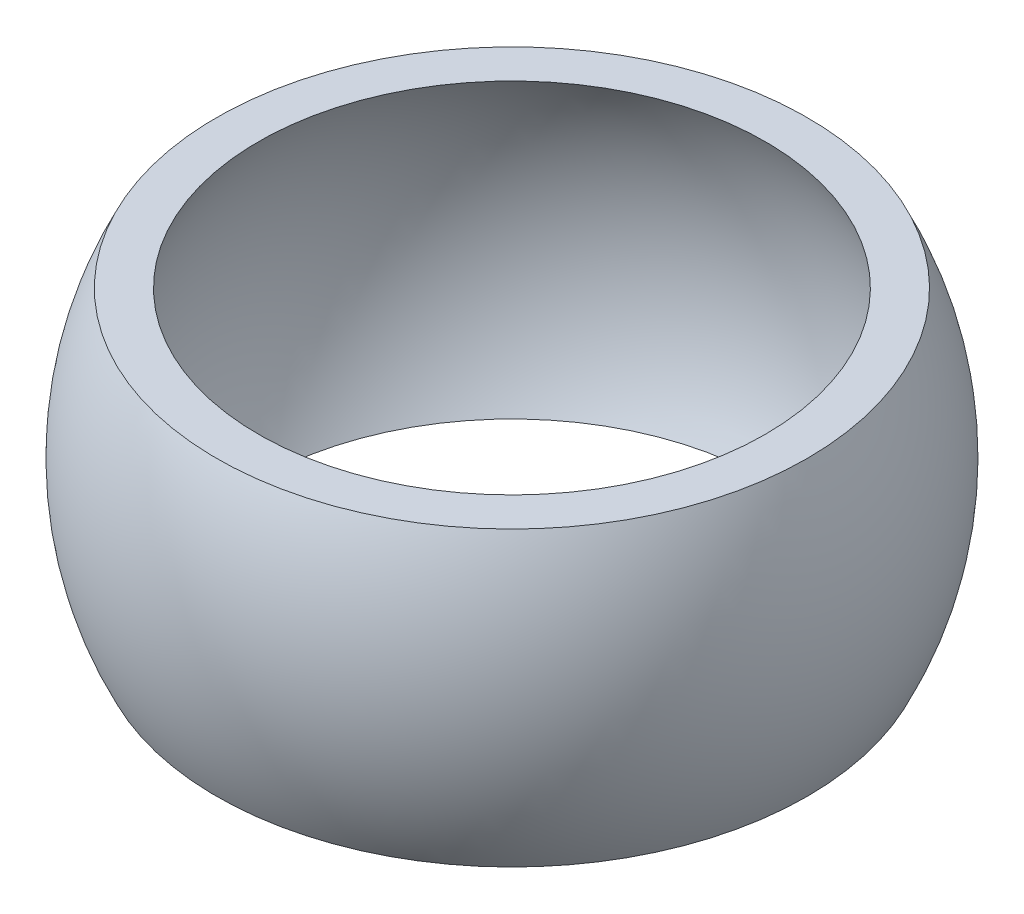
from build123d import *


with BuildPart() as part:
    # Sketch1 → Revolve1 (revolve)
    with BuildSketch(Plane.XY):
        with BuildLine():
            Line((12.124355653, 7), (14.124355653, 7))
            ThreePointArc((14.124355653, 7), (15.76380102, 0), (14.124355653, -7))
            Line((14.124355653, -7), (12.124355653, -7))
            ThreePointArc((12.124355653, -7), (13.522961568, -3.623466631), (14, 0))
            ThreePointArc((14, 0), (13.522961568, 3.623466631), (12.124355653, 7))
        make_face()
    revolve(axis=Axis((0, 0, 0), (0, 1, 0)))


solid = part.part
